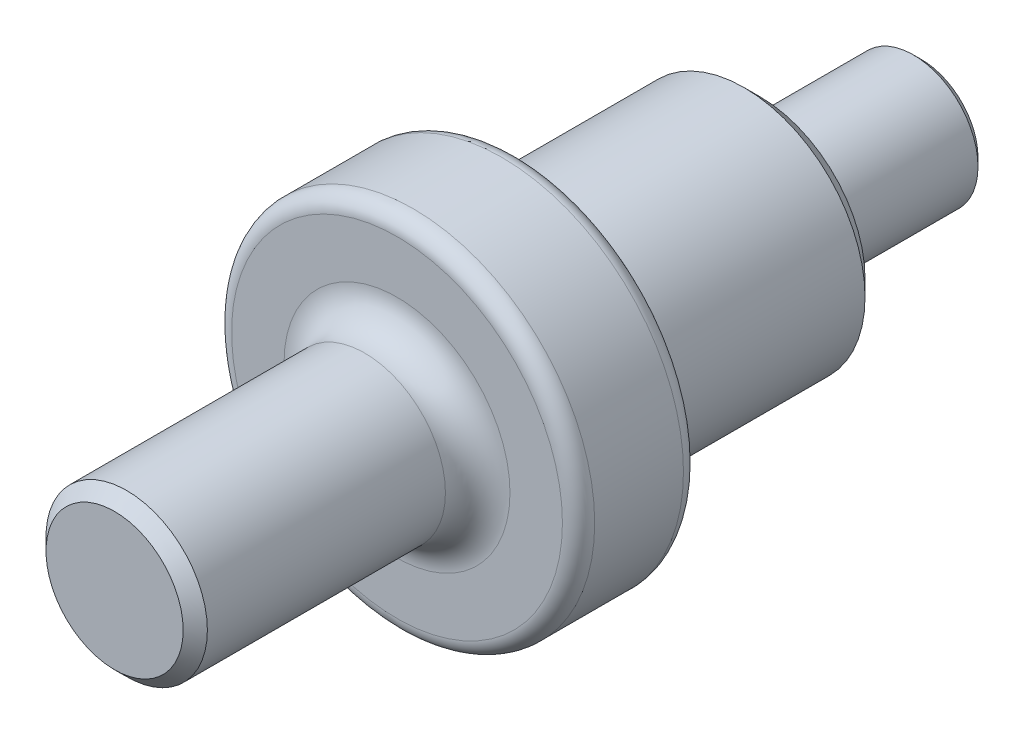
ISO-10303-21;
HEADER;
FILE_DESCRIPTION(('STEP AP214'),'2;1');
FILE_NAME('part.step','',(''),(''),'','','');
FILE_SCHEMA(('AUTOMOTIVE_DESIGN { 1 0 10303 214 1 1 1 1 }'));
ENDSEC;
DATA;
#1=APPLICATION_CONTEXT('core data for automotive mechanical design processes');
#2=APPLICATION_PROTOCOL_DEFINITION('international standard','automotive_design',2000,#1);
#3=PRODUCT_CONTEXT('',#1,'mechanical');
#4=PRODUCT('Part','Part','',(#3));
#5=PRODUCT_RELATED_PRODUCT_CATEGORY('part','',(#4));
#6=PRODUCT_DEFINITION_FORMATION('','',#4);
#7=PRODUCT_DEFINITION_CONTEXT('part definition',#1,'design');
#8=PRODUCT_DEFINITION('design','',#6,#7);
#9=PRODUCT_DEFINITION_SHAPE('','',#8);
#10=(LENGTH_UNIT() NAMED_UNIT(*) SI_UNIT(.MILLI.,.METRE.));
#11=(NAMED_UNIT(*) PLANE_ANGLE_UNIT() SI_UNIT($,.RADIAN.));
#12=(NAMED_UNIT(*) SI_UNIT($,.STERADIAN.) SOLID_ANGLE_UNIT());
#13=UNCERTAINTY_MEASURE_WITH_UNIT(LENGTH_MEASURE(1.E-05),#10,'distance_accuracy_value','');
#14=(GEOMETRIC_REPRESENTATION_CONTEXT(3) GLOBAL_UNCERTAINTY_ASSIGNED_CONTEXT((#13)) GLOBAL_UNIT_ASSIGNED_CONTEXT((#10,
#11,#12)) REPRESENTATION_CONTEXT('',''));
#15=CARTESIAN_POINT('',(0.,0.,0.));
#16=DIRECTION('',(0.,0.,1.));
#17=DIRECTION('',(1.,0.,0.));
#18=AXIS2_PLACEMENT_3D('',#15,#16,#17);
#19=CARTESIAN_POINT('',(0.,0.,20.));
#20=DIRECTION('',(0.,0.,-1.));
#21=DIRECTION('',(-1.,0.,0.));
#22=AXIS2_PLACEMENT_3D('',#19,#20,#21);
#23=CYLINDRICAL_SURFACE('',#22,8.);
#24=CARTESIAN_POINT('',(0.,0.,1.00000000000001));
#25=DIRECTION('',(0.,0.,1.));
#26=DIRECTION('',(1.,0.,0.));
#27=AXIS2_PLACEMENT_3D('',#24,#25,#26);
#28=CIRCLE('',#27,8.);
#29=CARTESIAN_POINT('',(8.,0.,1.00000000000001));
#30=VERTEX_POINT('',#29);
#31=EDGE_CURVE('E96',#30,#30,#28,.T.);
#32=ORIENTED_EDGE('',*,*,#31,.T.);
#33=EDGE_LOOP('',(#32));
#34=FACE_BOUND('',#33,.T.);
#35=CARTESIAN_POINT('',(0.,0.,20.));
#36=DIRECTION('',(0.,0.,1.));
#37=DIRECTION('',(1.,0.,0.));
#38=AXIS2_PLACEMENT_3D('',#35,#36,#37);
#39=CIRCLE('',#38,8.);
#40=CARTESIAN_POINT('',(8.,0.,20.));
#41=VERTEX_POINT('',#40);
#42=EDGE_CURVE('E100',#41,#41,#39,.T.);
#43=ORIENTED_EDGE('',*,*,#42,.F.);
#44=EDGE_LOOP('',(#43));
#45=FACE_BOUND('',#44,.T.);
#46=ADVANCED_FACE('F44',(#34,#45),#23,.T.);
#47=CARTESIAN_POINT('',(0.,0.,0.));
#48=DIRECTION('',(0.,0.,1.));
#49=DIRECTION('',(1.,0.,0.));
#50=AXIS2_PLACEMENT_3D('',#47,#48,#49);
#51=PLANE('',#50);
#52=CARTESIAN_POINT('',(0.,0.,0.));
#53=DIRECTION('',(0.,0.,1.));
#54=DIRECTION('',(1.,0.,0.));
#55=AXIS2_PLACEMENT_3D('',#52,#53,#54);
#56=CIRCLE('',#55,6.99999999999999);
#57=CARTESIAN_POINT('',(6.99999999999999,0.,0.));
#58=VERTEX_POINT('',#57);
#59=EDGE_CURVE('E92',#58,#58,#56,.F.);
#60=ORIENTED_EDGE('',*,*,#59,.T.);
#61=EDGE_LOOP('',(#60));
#62=FACE_BOUND('',#61,.T.);
#63=ADVANCED_FACE('F114',(#62),#51,.F.);
#64=CARTESIAN_POINT('',(0.,0.,50.));
#65=DIRECTION('',(0.,0.,-1.));
#66=DIRECTION('',(-1.,0.,0.));
#67=AXIS2_PLACEMENT_3D('',#64,#65,#66);
#68=CYLINDRICAL_SURFACE('',#67,15.);
#69=CARTESIAN_POINT('',(0.,0.,22.));
#70=DIRECTION('',(0.,0.,1.));
#71=DIRECTION('',(1.,0.,0.));
#72=AXIS2_PLACEMENT_3D('',#69,#70,#71);
#73=CIRCLE('',#72,15.);
#74=CARTESIAN_POINT('',(15.,0.,22.));
#75=VERTEX_POINT('',#74);
#76=EDGE_CURVE('E88',#75,#75,#73,.T.);
#77=ORIENTED_EDGE('',*,*,#76,.T.);
#78=EDGE_LOOP('',(#77));
#79=FACE_BOUND('',#78,.T.);
#80=CARTESIAN_POINT('',(0.,0.,50.));
#81=DIRECTION('',(0.,0.,1.));
#82=DIRECTION('',(1.,0.,0.));
#83=AXIS2_PLACEMENT_3D('',#80,#81,#82);
#84=CIRCLE('',#83,15.);
#85=CARTESIAN_POINT('',(15.,0.,50.));
#86=VERTEX_POINT('',#85);
#87=EDGE_CURVE('E104',#86,#86,#84,.T.);
#88=ORIENTED_EDGE('',*,*,#87,.F.);
#89=EDGE_LOOP('',(#88));
#90=FACE_BOUND('',#89,.T.);
#91=ADVANCED_FACE('F111',(#79,#90),#68,.T.);
#92=CARTESIAN_POINT('',(0.,0.,20.));
#93=DIRECTION('',(0.,0.,1.));
#94=DIRECTION('',(1.,0.,0.));
#95=AXIS2_PLACEMENT_3D('',#92,#93,#94);
#96=PLANE('',#95);
#97=CARTESIAN_POINT('',(0.,0.,20.));
#98=DIRECTION('',(0.,0.,1.));
#99=DIRECTION('',(1.,0.,0.));
#100=AXIS2_PLACEMENT_3D('',#97,#98,#99);
#101=CIRCLE('',#100,13.);
#102=CARTESIAN_POINT('',(13.,0.,20.));
#103=VERTEX_POINT('',#102);
#104=EDGE_CURVE('E84',#103,#103,#101,.F.);
#105=ORIENTED_EDGE('',*,*,#104,.T.);
#106=EDGE_LOOP('',(#105));
#107=FACE_BOUND('',#106,.T.);
#108=ORIENTED_EDGE('',*,*,#42,.T.);
#109=EDGE_LOOP('',(#108));
#110=FACE_BOUND('',#109,.T.);
#111=ADVANCED_FACE('F113',(#107,#110),#96,.F.);
#112=CARTESIAN_POINT('',(0.,0.,65.));
#113=DIRECTION('',(0.,0.,-1.));
#114=DIRECTION('',(-1.,0.,0.));
#115=AXIS2_PLACEMENT_3D('',#112,#113,#114);
#116=CYLINDRICAL_SURFACE('',#115,22.5);
#117=CARTESIAN_POINT('',(0.,0.,63.));
#118=DIRECTION('',(0.,0.,1.));
#119=DIRECTION('',(1.,0.,0.));
#120=AXIS2_PLACEMENT_3D('',#117,#118,#119);
#121=CIRCLE('',#120,22.5);
#122=CARTESIAN_POINT('',(22.5,0.,63.));
#123=VERTEX_POINT('',#122);
#124=EDGE_CURVE('E57',#123,#123,#121,.F.);
#125=ORIENTED_EDGE('',*,*,#124,.T.);
#126=EDGE_LOOP('',(#125));
#127=FACE_BOUND('',#126,.T.);
#128=CARTESIAN_POINT('',(0.,0.,52.));
#129=DIRECTION('',(0.,0.,1.));
#130=DIRECTION('',(1.,0.,0.));
#131=AXIS2_PLACEMENT_3D('',#128,#129,#130);
#132=CIRCLE('',#131,22.5);
#133=CARTESIAN_POINT('',(22.5,0.,52.));
#134=VERTEX_POINT('',#133);
#135=EDGE_CURVE('E72',#134,#134,#132,.T.);
#136=ORIENTED_EDGE('',*,*,#135,.T.);
#137=EDGE_LOOP('',(#136));
#138=FACE_BOUND('',#137,.T.);
#139=ADVANCED_FACE('F121',(#127,#138),#116,.T.);
#140=CARTESIAN_POINT('',(0.,0.,65.));
#141=DIRECTION('',(0.,0.,1.));
#142=DIRECTION('',(1.,0.,0.));
#143=AXIS2_PLACEMENT_3D('',#140,#141,#142);
#144=PLANE('',#143);
#145=CARTESIAN_POINT('',(0.,0.,65.));
#146=DIRECTION('',(0.,0.,1.));
#147=DIRECTION('',(1.,0.,0.));
#148=AXIS2_PLACEMENT_3D('',#145,#146,#147);
#149=CIRCLE('',#148,14.);
#150=CARTESIAN_POINT('',(14.,0.,65.));
#151=VERTEX_POINT('',#150);
#152=EDGE_CURVE('E10',#151,#151,#149,.F.);
#153=ORIENTED_EDGE('',*,*,#152,.T.);
#154=EDGE_LOOP('',(#153));
#155=FACE_BOUND('',#154,.T.);
#156=CARTESIAN_POINT('',(0.,0.,65.));
#157=DIRECTION('',(0.,0.,1.));
#158=DIRECTION('',(1.,0.,0.));
#159=AXIS2_PLACEMENT_3D('',#156,#157,#158);
#160=CIRCLE('',#159,20.5);
#161=CARTESIAN_POINT('',(20.5,0.,65.));
#162=VERTEX_POINT('',#161);
#163=EDGE_CURVE('E62',#162,#162,#160,.T.);
#164=ORIENTED_EDGE('',*,*,#163,.T.);
#165=EDGE_LOOP('',(#164));
#166=FACE_BOUND('',#165,.T.);
#167=ADVANCED_FACE('F169',(#155,#166),#144,.T.);
#168=CARTESIAN_POINT('',(0.,0.,50.));
#169=DIRECTION('',(0.,0.,1.));
#170=DIRECTION('',(1.,0.,0.));
#171=AXIS2_PLACEMENT_3D('',#168,#169,#170);
#172=PLANE('',#171);
#173=CARTESIAN_POINT('',(0.,0.,50.));
#174=DIRECTION('',(0.,0.,1.));
#175=DIRECTION('',(1.,0.,0.));
#176=AXIS2_PLACEMENT_3D('',#173,#174,#175);
#177=CIRCLE('',#176,20.5);
#178=CARTESIAN_POINT('',(20.5,0.,50.));
#179=VERTEX_POINT('',#178);
#180=EDGE_CURVE('E68',#179,#179,#177,.F.);
#181=ORIENTED_EDGE('',*,*,#180,.T.);
#182=EDGE_LOOP('',(#181));
#183=FACE_BOUND('',#182,.T.);
#184=ORIENTED_EDGE('',*,*,#87,.T.);
#185=EDGE_LOOP('',(#184));
#186=FACE_BOUND('',#185,.T.);
#187=ADVANCED_FACE('F109',(#183,#186),#172,.F.);
#188=CARTESIAN_POINT('',(0.,0.,100.));
#189=DIRECTION('',(0.,0.,-1.));
#190=DIRECTION('',(-1.,0.,0.));
#191=AXIS2_PLACEMENT_3D('',#188,#189,#190);
#192=CYLINDRICAL_SURFACE('',#191,10.);
#193=CARTESIAN_POINT('',(0.,0.,69.));
#194=DIRECTION('',(0.,0.,1.));
#195=DIRECTION('',(1.,0.,0.));
#196=AXIS2_PLACEMENT_3D('',#193,#194,#195);
#197=CIRCLE('',#196,10.);
#198=CARTESIAN_POINT('',(10.,0.,69.));
#199=VERTEX_POINT('',#198);
#200=EDGE_CURVE('E52',#199,#199,#197,.T.);
#201=ORIENTED_EDGE('',*,*,#200,.T.);
#202=EDGE_LOOP('',(#201));
#203=FACE_BOUND('',#202,.T.);
#204=CARTESIAN_POINT('',(0.,0.,98.5));
#205=DIRECTION('',(0.,0.,1.));
#206=DIRECTION('',(1.,0.,0.));
#207=AXIS2_PLACEMENT_3D('',#204,#205,#206);
#208=CIRCLE('',#207,10.);
#209=CARTESIAN_POINT('',(10.,0.,98.5));
#210=VERTEX_POINT('',#209);
#211=EDGE_CURVE('E76',#210,#210,#208,.F.);
#212=ORIENTED_EDGE('',*,*,#211,.T.);
#213=EDGE_LOOP('',(#212));
#214=FACE_BOUND('',#213,.T.);
#215=ADVANCED_FACE('F176',(#203,#214),#192,.T.);
#216=CARTESIAN_POINT('',(0.,0.,100.));
#217=DIRECTION('',(0.,0.,1.));
#218=DIRECTION('',(1.,0.,0.));
#219=AXIS2_PLACEMENT_3D('',#216,#217,#218);
#220=PLANE('',#219);
#221=CARTESIAN_POINT('',(0.,0.,100.));
#222=DIRECTION('',(0.,0.,1.));
#223=DIRECTION('',(1.,0.,0.));
#224=AXIS2_PLACEMENT_3D('',#221,#222,#223);
#225=CIRCLE('',#224,8.50000000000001);
#226=CARTESIAN_POINT('',(8.50000000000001,0.,100.));
#227=VERTEX_POINT('',#226);
#228=EDGE_CURVE('E80',#227,#227,#225,.T.);
#229=ORIENTED_EDGE('',*,*,#228,.T.);
#230=EDGE_LOOP('',(#229));
#231=FACE_BOUND('',#230,.T.);
#232=ADVANCED_FACE('F141',(#231),#220,.T.);
#233=CARTESIAN_POINT('',(0.,0.,1.00000000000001));
#234=DIRECTION('',(0.,0.,1.));
#235=DIRECTION('',(1.,0.,0.));
#236=AXIS2_PLACEMENT_3D('',#233,#234,#235);
#237=CONICAL_SURFACE('',#236,8.,0.785398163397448);
#238=ORIENTED_EDGE('',*,*,#59,.F.);
#239=EDGE_LOOP('',(#238));
#240=FACE_BOUND('',#239,.T.);
#241=ORIENTED_EDGE('',*,*,#31,.F.);
#242=EDGE_LOOP('',(#241));
#243=FACE_BOUND('',#242,.T.);
#244=ADVANCED_FACE('F134',(#240,#243),#237,.T.);
#245=CARTESIAN_POINT('',(0.,0.,22.));
#246=DIRECTION('',(0.,0.,1.));
#247=DIRECTION('',(1.,0.,0.));
#248=AXIS2_PLACEMENT_3D('',#245,#246,#247);
#249=CONICAL_SURFACE('',#248,15.,0.785398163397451);
#250=ORIENTED_EDGE('',*,*,#104,.F.);
#251=EDGE_LOOP('',(#250));
#252=FACE_BOUND('',#251,.T.);
#253=ORIENTED_EDGE('',*,*,#76,.F.);
#254=EDGE_LOOP('',(#253));
#255=FACE_BOUND('',#254,.T.);
#256=ADVANCED_FACE('F140',(#252,#255),#249,.T.);
#257=CARTESIAN_POINT('',(0.,0.,100.));
#258=DIRECTION('',(0.,0.,-1.));
#259=DIRECTION('',(-1.,0.,0.));
#260=AXIS2_PLACEMENT_3D('',#257,#258,#259);
#261=CONICAL_SURFACE('',#260,8.50000000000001,0.785398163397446);
#262=ORIENTED_EDGE('',*,*,#211,.F.);
#263=EDGE_LOOP('',(#262));
#264=FACE_BOUND('',#263,.T.);
#265=ORIENTED_EDGE('',*,*,#228,.F.);
#266=EDGE_LOOP('',(#265));
#267=FACE_BOUND('',#266,.T.);
#268=ADVANCED_FACE('F148',(#264,#267),#261,.T.);
#269=CARTESIAN_POINT('',(0.,0.,52.));
#270=DIRECTION('',(0.,0.,1.));
#271=DIRECTION('',(1.,0.,0.));
#272=AXIS2_PLACEMENT_3D('',#269,#270,#271);
#273=TOROIDAL_SURFACE('',#272,20.5,2.);
#274=ORIENTED_EDGE('',*,*,#180,.F.);
#275=EDGE_LOOP('',(#274));
#276=FACE_BOUND('',#275,.T.);
#277=ORIENTED_EDGE('',*,*,#135,.F.);
#278=EDGE_LOOP('',(#277));
#279=FACE_BOUND('',#278,.T.);
#280=ADVANCED_FACE('F154',(#276,#279),#273,.T.);
#281=CARTESIAN_POINT('',(0.,0.,63.));
#282=DIRECTION('',(0.,0.,1.));
#283=DIRECTION('',(1.,0.,0.));
#284=AXIS2_PLACEMENT_3D('',#281,#282,#283);
#285=TOROIDAL_SURFACE('',#284,20.5,2.);
#286=ORIENTED_EDGE('',*,*,#124,.F.);
#287=EDGE_LOOP('',(#286));
#288=FACE_BOUND('',#287,.T.);
#289=ORIENTED_EDGE('',*,*,#163,.F.);
#290=EDGE_LOOP('',(#289));
#291=FACE_BOUND('',#290,.T.);
#292=ADVANCED_FACE('F157',(#288,#291),#285,.T.);
#293=CARTESIAN_POINT('',(0.,0.,69.));
#294=DIRECTION('',(0.,0.,1.));
#295=DIRECTION('',(1.,0.,0.));
#296=AXIS2_PLACEMENT_3D('',#293,#294,#295);
#297=TOROIDAL_SURFACE('',#296,14.,4.);
#298=ORIENTED_EDGE('',*,*,#152,.F.);
#299=EDGE_LOOP('',(#298));
#300=FACE_BOUND('',#299,.T.);
#301=ORIENTED_EDGE('',*,*,#200,.F.);
#302=EDGE_LOOP('',(#301));
#303=FACE_BOUND('',#302,.T.);
#304=ADVANCED_FACE('F46',(#300,#303),#297,.F.);
#305=CLOSED_SHELL('',(#46,#63,#91,#111,#139,#167,#187,#215,#232,#244,#256,#268,#280,#292,#304));
#306=MANIFOLD_SOLID_BREP('B2',#305);
#307=ADVANCED_BREP_SHAPE_REPRESENTATION('',(#18,#306),#14);
#308=SHAPE_DEFINITION_REPRESENTATION(#9,#307);
ENDSEC;
END-ISO-10303-21;
